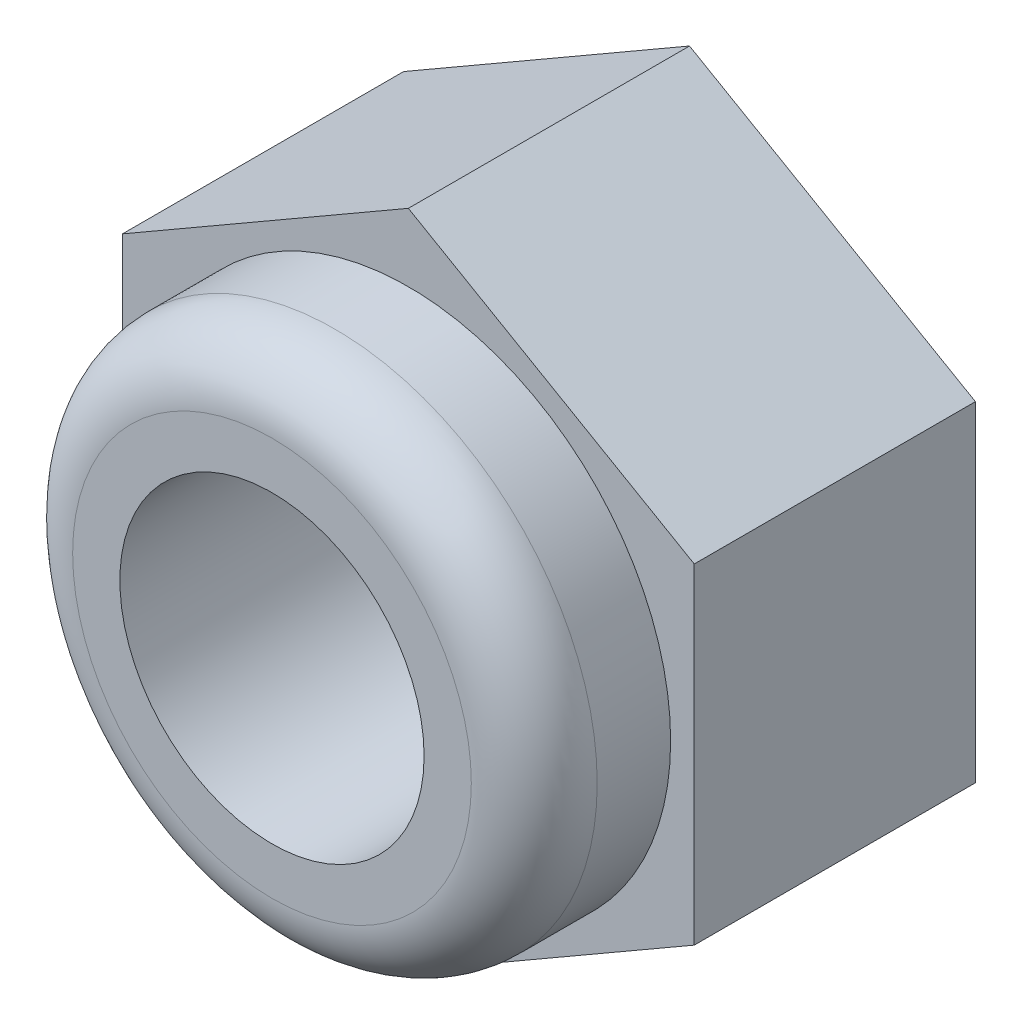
from build123d import *

# Parameters (mm, degrees)
ESQUISSE1_R        = 1.45
EXTRUSION1_DEPTH   = 2.68
ESQUISSE2_R        = 2.5
ESQUISSE2_R_2      = 1.45
BOSS_EXTRU_1_DEPTH = 1.3
CONG_1_R           = 0.6


with BuildPart() as part:
    # Esquisse1 → Extrusion1 (new body)
    with BuildSketch(Plane.XY):
        Polygon((0, 3.146558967), (-2.725, 1.573279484), (-2.725, -1.573279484), (0, -3.146558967), (2.725, -1.573279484), (2.725, 1.573279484), align=None)
        Circle(ESQUISSE1_R, mode=Mode.SUBTRACT)
    extrude(amount=EXTRUSION1_DEPTH)

    # Esquisse2 → Boss.-Extru.1 (add)
    with BuildSketch(Plane.XY.offset(2.68)):
        Circle(ESQUISSE2_R)
        Circle(ESQUISSE2_R_2, mode=Mode.SUBTRACT)
    extrude(amount=BOSS_EXTRU_1_DEPTH)

    # Cong_1
    cong_1_edges = [part.edges().sort_by_distance(p)[0] for p in [
        (-2.5, 0, 3.98),
    ]]
    fillet(cong_1_edges, radius=CONG_1_R)


solid = part.part
